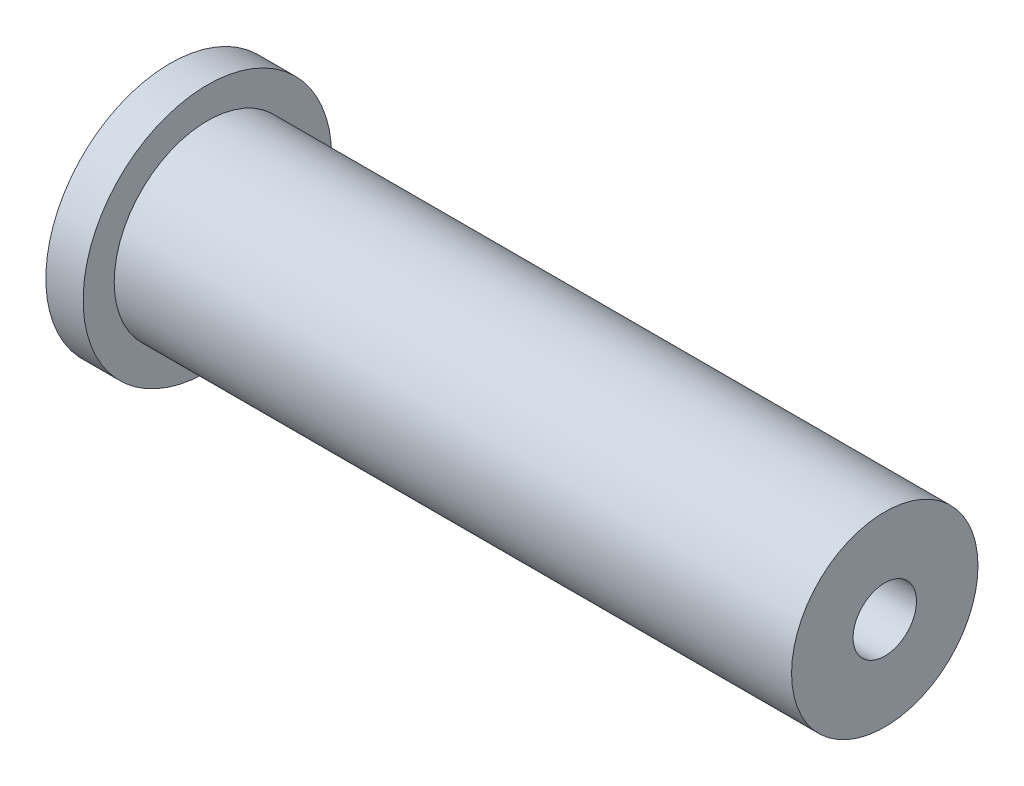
ISO-10303-21;
HEADER;
FILE_DESCRIPTION(('STEP AP214'),'2;1');
FILE_NAME('part.step','',(''),(''),'','','');
FILE_SCHEMA(('AUTOMOTIVE_DESIGN { 1 0 10303 214 1 1 1 1 }'));
ENDSEC;
DATA;
#1=APPLICATION_CONTEXT('core data for automotive mechanical design processes');
#2=APPLICATION_PROTOCOL_DEFINITION('international standard','automotive_design',2000,#1);
#3=PRODUCT_CONTEXT('',#1,'mechanical');
#4=PRODUCT('Part','Part','',(#3));
#5=PRODUCT_RELATED_PRODUCT_CATEGORY('part','',(#4));
#6=PRODUCT_DEFINITION_FORMATION('','',#4);
#7=PRODUCT_DEFINITION_CONTEXT('part definition',#1,'design');
#8=PRODUCT_DEFINITION('design','',#6,#7);
#9=PRODUCT_DEFINITION_SHAPE('','',#8);
#10=(LENGTH_UNIT() NAMED_UNIT(*) SI_UNIT(.MILLI.,.METRE.));
#11=(NAMED_UNIT(*) PLANE_ANGLE_UNIT() SI_UNIT($,.RADIAN.));
#12=(NAMED_UNIT(*) SI_UNIT($,.STERADIAN.) SOLID_ANGLE_UNIT());
#13=UNCERTAINTY_MEASURE_WITH_UNIT(LENGTH_MEASURE(1.E-05),#10,'distance_accuracy_value','');
#14=(GEOMETRIC_REPRESENTATION_CONTEXT(3) GLOBAL_UNCERTAINTY_ASSIGNED_CONTEXT((#13)) GLOBAL_UNIT_ASSIGNED_CONTEXT((#10,
#11,#12)) REPRESENTATION_CONTEXT('',''));
#15=CARTESIAN_POINT('',(0.,0.,0.));
#16=DIRECTION('',(0.,0.,1.));
#17=DIRECTION('',(1.,0.,0.));
#18=AXIS2_PLACEMENT_3D('',#15,#16,#17);
#19=CARTESIAN_POINT('',(0.,0.,0.));
#20=DIRECTION('',(-1.,0.,0.));
#21=DIRECTION('',(0.,0.,1.));
#22=AXIS2_PLACEMENT_3D('',#19,#20,#21);
#23=PLANE('',#22);
#24=CARTESIAN_POINT('',(0.,0.,0.));
#25=DIRECTION('',(1.,0.,0.));
#26=DIRECTION('',(0.,0.,-1.));
#27=AXIS2_PLACEMENT_3D('',#24,#25,#26);
#28=CIRCLE('',#27,10.);
#29=CARTESIAN_POINT('',(0.,0.,-10.));
#30=VERTEX_POINT('',#29);
#31=EDGE_CURVE('E10',#30,#30,#28,.T.);
#32=ORIENTED_EDGE('',*,*,#31,.F.);
#33=EDGE_LOOP('',(#32));
#34=FACE_BOUND('',#33,.T.);
#35=ADVANCED_FACE('F33',(#34),#23,.T.);
#36=CARTESIAN_POINT('',(0.,0.,0.));
#37=DIRECTION('',(1.,0.,0.));
#38=DIRECTION('',(0.,0.,-1.));
#39=AXIS2_PLACEMENT_3D('',#36,#37,#38);
#40=CYLINDRICAL_SURFACE('',#39,10.);
#41=ORIENTED_EDGE('',*,*,#31,.T.);
#42=EDGE_LOOP('',(#41));
#43=FACE_BOUND('',#42,.T.);
#44=CARTESIAN_POINT('',(3.,0.,0.));
#45=DIRECTION('',(1.,0.,0.));
#46=DIRECTION('',(0.,0.,-1.));
#47=AXIS2_PLACEMENT_3D('',#44,#45,#46);
#48=CIRCLE('',#47,10.);
#49=CARTESIAN_POINT('',(3.,0.,-10.));
#50=VERTEX_POINT('',#49);
#51=EDGE_CURVE('E39',#50,#50,#48,.T.);
#52=ORIENTED_EDGE('',*,*,#51,.F.);
#53=EDGE_LOOP('',(#52));
#54=FACE_BOUND('',#53,.T.);
#55=ADVANCED_FACE('F81',(#43,#54),#40,.T.);
#56=CARTESIAN_POINT('',(3.,10.,0.));
#57=DIRECTION('',(1.,0.,0.));
#58=DIRECTION('',(0.,0.,-1.));
#59=AXIS2_PLACEMENT_3D('',#56,#57,#58);
#60=PLANE('',#59);
#61=ORIENTED_EDGE('',*,*,#51,.T.);
#62=EDGE_LOOP('',(#61));
#63=FACE_BOUND('',#62,.T.);
#64=CARTESIAN_POINT('',(3.,0.,0.));
#65=DIRECTION('',(1.,0.,0.));
#66=DIRECTION('',(0.,0.,-1.));
#67=AXIS2_PLACEMENT_3D('',#64,#65,#66);
#68=CIRCLE('',#67,7.5);
#69=CARTESIAN_POINT('',(3.,0.,-7.5));
#70=VERTEX_POINT('',#69);
#71=EDGE_CURVE('E43',#70,#70,#68,.T.);
#72=ORIENTED_EDGE('',*,*,#71,.F.);
#73=EDGE_LOOP('',(#72));
#74=FACE_BOUND('',#73,.T.);
#75=ADVANCED_FACE('F75',(#63,#74),#60,.T.);
#76=CARTESIAN_POINT('',(0.,0.,0.));
#77=DIRECTION('',(1.,0.,0.));
#78=DIRECTION('',(0.,0.,-1.));
#79=AXIS2_PLACEMENT_3D('',#76,#77,#78);
#80=CYLINDRICAL_SURFACE('',#79,7.5);
#81=ORIENTED_EDGE('',*,*,#71,.T.);
#82=EDGE_LOOP('',(#81));
#83=FACE_BOUND('',#82,.T.);
#84=CARTESIAN_POINT('',(57.5,0.,0.));
#85=DIRECTION('',(1.,0.,0.));
#86=DIRECTION('',(0.,0.,-1.));
#87=AXIS2_PLACEMENT_3D('',#84,#85,#86);
#88=CIRCLE('',#87,7.5);
#89=CARTESIAN_POINT('',(57.5,0.,-7.5));
#90=VERTEX_POINT('',#89);
#91=EDGE_CURVE('E47',#90,#90,#88,.T.);
#92=ORIENTED_EDGE('',*,*,#91,.F.);
#93=EDGE_LOOP('',(#92));
#94=FACE_BOUND('',#93,.T.);
#95=ADVANCED_FACE('F70',(#83,#94),#80,.T.);
#96=CARTESIAN_POINT('',(57.5,7.5,0.));
#97=DIRECTION('',(1.,0.,0.));
#98=DIRECTION('',(0.,0.,-1.));
#99=AXIS2_PLACEMENT_3D('',#96,#97,#98);
#100=PLANE('',#99);
#101=CARTESIAN_POINT('',(57.5,0.,0.));
#102=DIRECTION('',(1.,0.,0.));
#103=DIRECTION('',(0.,0.,-1.));
#104=AXIS2_PLACEMENT_3D('',#101,#102,#103);
#105=CIRCLE('',#104,2.55);
#106=CARTESIAN_POINT('',(57.5,0.,-2.55));
#107=VERTEX_POINT('',#106);
#108=EDGE_CURVE('E53',#107,#107,#105,.T.);
#109=ORIENTED_EDGE('',*,*,#108,.F.);
#110=EDGE_LOOP('',(#109));
#111=FACE_BOUND('',#110,.T.);
#112=ORIENTED_EDGE('',*,*,#91,.T.);
#113=EDGE_LOOP('',(#112));
#114=FACE_BOUND('',#113,.T.);
#115=ADVANCED_FACE('F64',(#111,#114),#100,.T.);
#116=CARTESIAN_POINT('',(47.5,0.,0.));
#117=DIRECTION('',(1.,0.,0.));
#118=DIRECTION('',(0.,0.,-1.));
#119=AXIS2_PLACEMENT_3D('',#116,#117,#118);
#120=CYLINDRICAL_SURFACE('',#119,2.55);
#121=CARTESIAN_POINT('',(47.5,0.,0.));
#122=DIRECTION('',(1.,0.,0.));
#123=DIRECTION('',(0.,0.,-1.));
#124=AXIS2_PLACEMENT_3D('',#121,#122,#123);
#125=CIRCLE('',#124,2.55);
#126=CARTESIAN_POINT('',(47.5,0.,-2.55));
#127=VERTEX_POINT('',#126);
#128=EDGE_CURVE('E52',#127,#127,#125,.T.);
#129=ORIENTED_EDGE('',*,*,#128,.F.);
#130=EDGE_LOOP('',(#129));
#131=FACE_BOUND('',#130,.T.);
#132=ORIENTED_EDGE('',*,*,#108,.T.);
#133=EDGE_LOOP('',(#132));
#134=FACE_BOUND('',#133,.T.);
#135=ADVANCED_FACE('F61',(#131,#134),#120,.F.);
#136=CARTESIAN_POINT('',(47.5,0.,0.));
#137=DIRECTION('',(1.,0.,0.));
#138=DIRECTION('',(0.,0.,-1.));
#139=AXIS2_PLACEMENT_3D('',#136,#137,#138);
#140=PLANE('',#139);
#141=ORIENTED_EDGE('',*,*,#128,.T.);
#142=EDGE_LOOP('',(#141));
#143=FACE_BOUND('',#142,.T.);
#144=ADVANCED_FACE('F59',(#143),#140,.T.);
#145=CLOSED_SHELL('',(#35,#55,#75,#95,#115,#135,#144));
#146=MANIFOLD_SOLID_BREP('B2',#145);
#147=ADVANCED_BREP_SHAPE_REPRESENTATION('',(#18,#146),#14);
#148=SHAPE_DEFINITION_REPRESENTATION(#9,#147);
ENDSEC;
END-ISO-10303-21;
